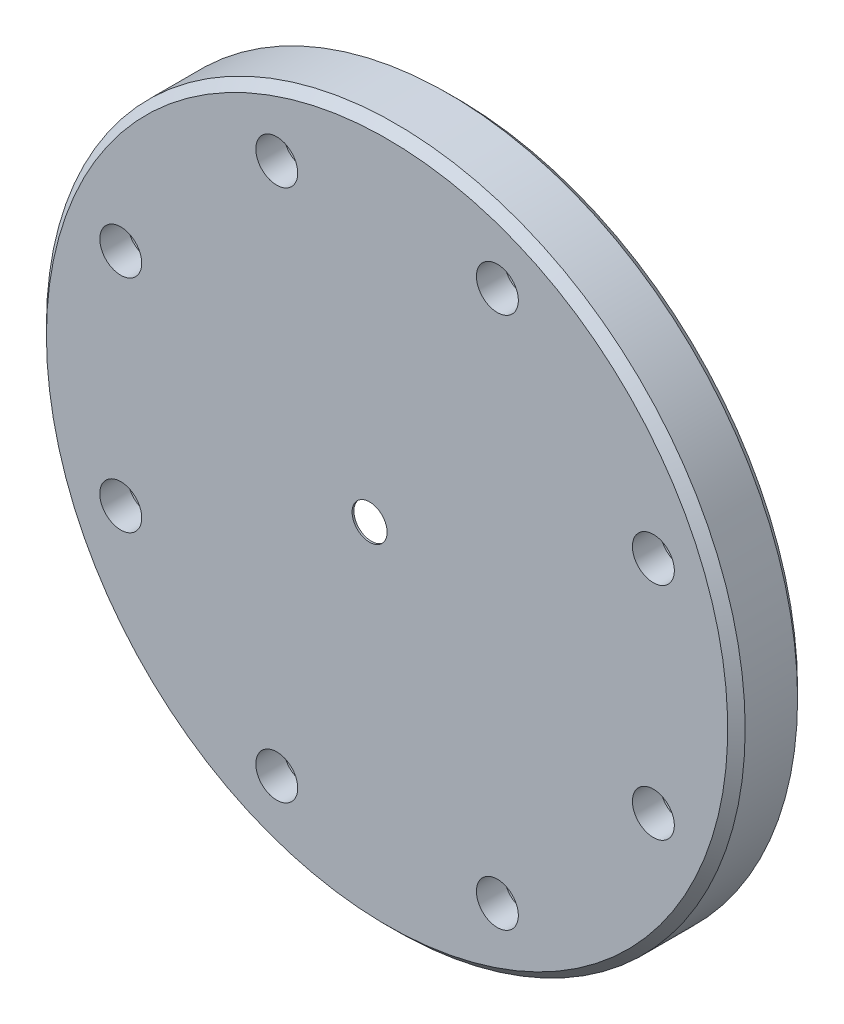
ISO-10303-21;
HEADER;
FILE_DESCRIPTION(('STEP AP214'),'2;1');
FILE_NAME('part.step','',(''),(''),'','','');
FILE_SCHEMA(('AUTOMOTIVE_DESIGN { 1 0 10303 214 1 1 1 1 }'));
ENDSEC;
DATA;
#1=APPLICATION_CONTEXT('core data for automotive mechanical design processes');
#2=APPLICATION_PROTOCOL_DEFINITION('international standard','automotive_design',2000,#1);
#3=PRODUCT_CONTEXT('',#1,'mechanical');
#4=PRODUCT('Part','Part','',(#3));
#5=PRODUCT_RELATED_PRODUCT_CATEGORY('part','',(#4));
#6=PRODUCT_DEFINITION_FORMATION('','',#4);
#7=PRODUCT_DEFINITION_CONTEXT('part definition',#1,'design');
#8=PRODUCT_DEFINITION('design','',#6,#7);
#9=PRODUCT_DEFINITION_SHAPE('','',#8);
#10=(LENGTH_UNIT() NAMED_UNIT(*) SI_UNIT(.MILLI.,.METRE.));
#11=(NAMED_UNIT(*) PLANE_ANGLE_UNIT() SI_UNIT($,.RADIAN.));
#12=(NAMED_UNIT(*) SI_UNIT($,.STERADIAN.) SOLID_ANGLE_UNIT());
#13=UNCERTAINTY_MEASURE_WITH_UNIT(LENGTH_MEASURE(1.E-05),#10,'distance_accuracy_value','');
#14=(GEOMETRIC_REPRESENTATION_CONTEXT(3) GLOBAL_UNCERTAINTY_ASSIGNED_CONTEXT((#13)) GLOBAL_UNIT_ASSIGNED_CONTEXT((#10,
#11,#12)) REPRESENTATION_CONTEXT('',''));
#15=CARTESIAN_POINT('',(0.,0.,0.));
#16=DIRECTION('',(0.,0.,1.));
#17=DIRECTION('',(1.,0.,0.));
#18=AXIS2_PLACEMENT_3D('',#15,#16,#17);
#19=CARTESIAN_POINT('',(0.,0.,-4.));
#20=DIRECTION('',(0.,0.,1.));
#21=DIRECTION('',(1.,0.,0.));
#22=AXIS2_PLACEMENT_3D('',#19,#20,#21);
#23=PLANE('',#22);
#24=CARTESIAN_POINT('',(0.,0.,-4.));
#25=DIRECTION('',(0.,0.,1.));
#26=DIRECTION('',(1.,0.,0.));
#27=AXIS2_PLACEMENT_3D('',#24,#25,#26);
#28=CIRCLE('',#27,19.5);
#29=CARTESIAN_POINT('',(19.5,0.,-4.));
#30=VERTEX_POINT('',#29);
#31=EDGE_CURVE('E42',#30,#30,#28,.F.);
#32=ORIENTED_EDGE('',*,*,#31,.T.);
#33=EDGE_LOOP('',(#32));
#34=FACE_BOUND('',#33,.T.);
#35=CARTESIAN_POINT('',(6.31427663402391,15.2440122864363,-4.));
#36=DIRECTION('',(0.,0.,-1.));
#37=DIRECTION('',(-1.,0.,0.));
#38=AXIS2_PLACEMENT_3D('',#35,#36,#37);
#39=CIRCLE('',#38,2.19999999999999);
#40=CARTESIAN_POINT('',(4.19245168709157,14.6627559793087,-4.));
#41=VERTEX_POINT('',#40);
#42=CARTESIAN_POINT('',(7.18854939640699,13.2251890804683,-4.));
#43=VERTEX_POINT('',#42);
#44=EDGE_CURVE('E48',#41,#43,#39,.T.);
#45=ORIENTED_EDGE('',*,*,#44,.F.);
#46=CARTESIAN_POINT('',(-1.,0.,-4.));
#47=DIRECTION('',(0.,0.,-1.));
#48=DIRECTION('',(-1.,0.,0.));
#49=AXIS2_PLACEMENT_3D('',#46,#47,#48);
#50=CIRCLE('',#49,15.5549981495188);
#51=CARTESIAN_POINT('',(-4.11428019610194,15.2400533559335,-4.));
#52=VERTEX_POINT('',#51);
#53=EDGE_CURVE('E108',#52,#41,#50,.T.);
#54=ORIENTED_EDGE('',*,*,#53,.F.);
#55=CARTESIAN_POINT('',(-6.31427663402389,15.2440122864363,-4.));
#56=DIRECTION('',(0.,0.,-1.));
#57=DIRECTION('',(-1.,0.,0.));
#58=AXIS2_PLACEMENT_3D('',#55,#56,#57);
#59=CIRCLE('',#58,2.19999999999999);
#60=CARTESIAN_POINT('',(-8.03501861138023,13.8732289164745,-4.));
#61=VERTEX_POINT('',#60);
#62=EDGE_CURVE('E116',#61,#52,#59,.T.);
#63=ORIENTED_EDGE('',*,*,#62,.F.);
#64=CARTESIAN_POINT('',(-14.1898872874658,8.24529203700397,-4.));
#65=VERTEX_POINT('',#64);
#66=EDGE_CURVE('E118',#65,#61,#50,.T.);
#67=ORIENTED_EDGE('',*,*,#66,.F.);
#68=CARTESIAN_POINT('',(-15.2440122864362,6.31427663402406,-4.));
#69=DIRECTION('',(0.,0.,-1.));
#70=DIRECTION('',(-1.,0.,0.));
#71=AXIS2_PLACEMENT_3D('',#68,#69,#70);
#72=CIRCLE('',#71,2.19999999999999);
#73=CARTESIAN_POINT('',(-15.9669762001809,4.23645970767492,-4.));
#74=VERTEX_POINT('',#73);
#75=EDGE_CURVE('E144',#74,#65,#72,.T.);
#76=ORIENTED_EDGE('',*,*,#75,.F.);
#77=CARTESIAN_POINT('',(-15.9669762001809,-4.23645970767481,-4.));
#78=VERTEX_POINT('',#77);
#79=EDGE_CURVE('E123',#78,#74,#50,.T.);
#80=ORIENTED_EDGE('',*,*,#79,.F.);
#81=CARTESIAN_POINT('',(-15.2440122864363,-6.31427663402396,-4.));
#82=DIRECTION('',(0.,0.,-1.));
#83=DIRECTION('',(-1.,0.,0.));
#84=AXIS2_PLACEMENT_3D('',#81,#82,#83);
#85=CIRCLE('',#84,2.19999999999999);
#86=CARTESIAN_POINT('',(-14.1898872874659,-8.24529203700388,-4.));
#87=VERTEX_POINT('',#86);
#88=EDGE_CURVE('E155',#87,#78,#85,.T.);
#89=ORIENTED_EDGE('',*,*,#88,.F.);
#90=CARTESIAN_POINT('',(-8.03501861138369,-13.8732289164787,-4.));
#91=VERTEX_POINT('',#90);
#92=EDGE_CURVE('E127',#91,#87,#50,.T.);
#93=ORIENTED_EDGE('',*,*,#92,.F.);
#94=CARTESIAN_POINT('',(-6.31427663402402,-15.2440122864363,-4.));
#95=DIRECTION('',(0.,0.,-1.));
#96=DIRECTION('',(-1.,0.,0.));
#97=AXIS2_PLACEMENT_3D('',#94,#95,#96);
#98=CIRCLE('',#97,2.19999999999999);
#99=CARTESIAN_POINT('',(-4.11428019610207,-15.2400533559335,-4.));
#100=VERTEX_POINT('',#99);
#101=EDGE_CURVE('E166',#100,#91,#98,.T.);
#102=ORIENTED_EDGE('',*,*,#101,.F.);
#103=CARTESIAN_POINT('',(4.19245168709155,-14.6627559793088,-4.));
#104=VERTEX_POINT('',#103);
#105=EDGE_CURVE('E567',#104,#100,#50,.T.);
#106=ORIENTED_EDGE('',*,*,#105,.F.);
#107=CARTESIAN_POINT('',(6.31427663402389,-15.2440122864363,-4.));
#108=DIRECTION('',(0.,0.,-1.));
#109=DIRECTION('',(-1.,0.,0.));
#110=AXIS2_PLACEMENT_3D('',#107,#108,#109);
#111=CIRCLE('',#110,2.19999999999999);
#112=CARTESIAN_POINT('',(7.18854939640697,-13.2251890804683,-4.));
#113=VERTEX_POINT('',#112);
#114=EDGE_CURVE('E177',#113,#104,#111,.T.);
#115=ORIENTED_EDGE('',*,*,#114,.F.);
#116=CARTESIAN_POINT('',(13.0678530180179,-6.63727947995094,-4.));
#117=VERTEX_POINT('',#116);
#118=EDGE_CURVE('E569',#117,#113,#50,.T.);
#119=ORIENTED_EDGE('',*,*,#118,.F.);
#120=CARTESIAN_POINT('',(15.2440122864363,-6.31427663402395,-4.));
#121=DIRECTION('',(0.,0.,-1.));
#122=DIRECTION('',(-1.,0.,0.));
#123=AXIS2_PLACEMENT_3D('',#120,#121,#122);
#124=CIRCLE('',#123,2.19999999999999);
#125=CARTESIAN_POINT('',(13.8573083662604,-4.60633862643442,-4.));
#126=VERTEX_POINT('',#125);
#127=EDGE_CURVE('E188',#126,#117,#124,.T.);
#128=ORIENTED_EDGE('',*,*,#127,.F.);
#129=CARTESIAN_POINT('',(13.8573083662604,4.60633862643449,-4.));
#130=VERTEX_POINT('',#129);
#131=EDGE_CURVE('E121',#130,#126,#50,.T.);
#132=ORIENTED_EDGE('',*,*,#131,.F.);
#133=CARTESIAN_POINT('',(15.2440122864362,6.31427663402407,-4.));
#134=DIRECTION('',(0.,0.,-1.));
#135=DIRECTION('',(-1.,0.,0.));
#136=AXIS2_PLACEMENT_3D('',#133,#134,#135);
#137=CIRCLE('',#136,2.19999999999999);
#138=CARTESIAN_POINT('',(13.0678530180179,6.63727947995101,-4.));
#139=VERTEX_POINT('',#138);
#140=EDGE_CURVE('E55',#139,#130,#137,.T.);
#141=ORIENTED_EDGE('',*,*,#140,.F.);
#142=EDGE_CURVE('E110',#43,#139,#50,.T.);
#143=ORIENTED_EDGE('',*,*,#142,.F.);
#144=EDGE_LOOP('',(#45,#54,#63,#67,#76,#80,#89,#93,#102,#106,#115,#119,#128,#132,#141,#143));
#145=FACE_BOUND('',#144,.T.);
#146=ADVANCED_FACE('F34',(#34,#145),#23,.F.);
#147=CARTESIAN_POINT('',(0.,0.,8.20296037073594));
#148=DIRECTION('',(0.,0.,1.));
#149=DIRECTION('',(1.,0.,0.));
#150=AXIS2_PLACEMENT_3D('',#147,#148,#149);
#151=CYLINDRICAL_SURFACE('',#150,20.);
#152=CARTESIAN_POINT('',(0.,0.,-3.5));
#153=DIRECTION('',(0.,0.,1.));
#154=DIRECTION('',(1.,0.,0.));
#155=AXIS2_PLACEMENT_3D('',#152,#153,#154);
#156=CIRCLE('',#155,20.);
#157=CARTESIAN_POINT('',(20.,0.,-3.5));
#158=VERTEX_POINT('',#157);
#159=EDGE_CURVE('E256',#158,#158,#156,.T.);
#160=ORIENTED_EDGE('',*,*,#159,.T.);
#161=EDGE_LOOP('',(#160));
#162=FACE_BOUND('',#161,.T.);
#163=CARTESIAN_POINT('',(0.,0.,-0.50000000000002));
#164=DIRECTION('',(0.,0.,-1.));
#165=DIRECTION('',(-1.,0.,0.));
#166=AXIS2_PLACEMENT_3D('',#163,#164,#165);
#167=CIRCLE('',#166,20.);
#168=CARTESIAN_POINT('',(-20.,0.,-0.50000000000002));
#169=VERTEX_POINT('',#168);
#170=EDGE_CURVE('E102',#169,#169,#167,.T.);
#171=ORIENTED_EDGE('',*,*,#170,.T.);
#172=EDGE_LOOP('',(#171));
#173=FACE_BOUND('',#172,.T.);
#174=ADVANCED_FACE('F227',(#162,#173),#151,.T.);
#175=CARTESIAN_POINT('',(0.,20.,0.));
#176=DIRECTION('',(0.,0.,-1.));
#177=DIRECTION('',(-1.,0.,0.));
#178=AXIS2_PLACEMENT_3D('',#175,#176,#177);
#179=PLANE('',#178);
#180=CARTESIAN_POINT('',(0.,0.,0.));
#181=DIRECTION('',(0.,0.,-1.));
#182=DIRECTION('',(-1.,0.,0.));
#183=AXIS2_PLACEMENT_3D('',#180,#181,#182);
#184=CIRCLE('',#183,19.5);
#185=CARTESIAN_POINT('',(-19.5,0.,0.));
#186=VERTEX_POINT('',#185);
#187=EDGE_CURVE('E11',#186,#186,#184,.F.);
#188=ORIENTED_EDGE('',*,*,#187,.T.);
#189=EDGE_LOOP('',(#188));
#190=FACE_BOUND('',#189,.T.);
#191=CARTESIAN_POINT('',(6.31427663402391,15.2440122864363,0.));
#192=DIRECTION('',(0.,0.,-1.));
#193=DIRECTION('',(-1.,0.,0.));
#194=AXIS2_PLACEMENT_3D('',#191,#192,#193);
#195=CIRCLE('',#194,1.2);
#196=CARTESIAN_POINT('',(5.11427663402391,15.2440122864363,0.));
#197=VERTEX_POINT('',#196);
#198=EDGE_CURVE('E200',#197,#197,#195,.T.);
#199=ORIENTED_EDGE('',*,*,#198,.T.);
#200=EDGE_LOOP('',(#199));
#201=FACE_BOUND('',#200,.T.);
#202=CARTESIAN_POINT('',(15.2440122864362,6.31427663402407,0.));
#203=DIRECTION('',(0.,0.,-1.));
#204=DIRECTION('',(-1.,0.,0.));
#205=AXIS2_PLACEMENT_3D('',#202,#203,#204);
#206=CIRCLE('',#205,1.2);
#207=CARTESIAN_POINT('',(14.0440122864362,6.31427663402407,0.));
#208=VERTEX_POINT('',#207);
#209=EDGE_CURVE('E190',#208,#208,#206,.T.);
#210=ORIENTED_EDGE('',*,*,#209,.T.);
#211=EDGE_LOOP('',(#210));
#212=FACE_BOUND('',#211,.T.);
#213=CARTESIAN_POINT('',(15.2440122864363,-6.31427663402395,0.));
#214=DIRECTION('',(0.,0.,-1.));
#215=DIRECTION('',(-1.,0.,0.));
#216=AXIS2_PLACEMENT_3D('',#213,#214,#215);
#217=CIRCLE('',#216,1.2);
#218=CARTESIAN_POINT('',(14.0440122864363,-6.31427663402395,0.));
#219=VERTEX_POINT('',#218);
#220=EDGE_CURVE('E179',#219,#219,#217,.T.);
#221=ORIENTED_EDGE('',*,*,#220,.T.);
#222=EDGE_LOOP('',(#221));
#223=FACE_BOUND('',#222,.T.);
#224=CARTESIAN_POINT('',(6.31427663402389,-15.2440122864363,0.));
#225=DIRECTION('',(0.,0.,-1.));
#226=DIRECTION('',(-1.,0.,0.));
#227=AXIS2_PLACEMENT_3D('',#224,#225,#226);
#228=CIRCLE('',#227,1.2);
#229=CARTESIAN_POINT('',(5.11427663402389,-15.2440122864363,0.));
#230=VERTEX_POINT('',#229);
#231=EDGE_CURVE('E168',#230,#230,#228,.T.);
#232=ORIENTED_EDGE('',*,*,#231,.T.);
#233=EDGE_LOOP('',(#232));
#234=FACE_BOUND('',#233,.T.);
#235=CARTESIAN_POINT('',(-6.31427663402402,-15.2440122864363,0.));
#236=DIRECTION('',(0.,0.,-1.));
#237=DIRECTION('',(-1.,0.,0.));
#238=AXIS2_PLACEMENT_3D('',#235,#236,#237);
#239=CIRCLE('',#238,1.2);
#240=CARTESIAN_POINT('',(-7.51427663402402,-15.2440122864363,0.));
#241=VERTEX_POINT('',#240);
#242=EDGE_CURVE('E157',#241,#241,#239,.T.);
#243=ORIENTED_EDGE('',*,*,#242,.T.);
#244=EDGE_LOOP('',(#243));
#245=FACE_BOUND('',#244,.T.);
#246=CARTESIAN_POINT('',(-15.2440122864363,-6.31427663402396,0.));
#247=DIRECTION('',(0.,0.,-1.));
#248=DIRECTION('',(-1.,0.,0.));
#249=AXIS2_PLACEMENT_3D('',#246,#247,#248);
#250=CIRCLE('',#249,1.2);
#251=CARTESIAN_POINT('',(-16.4440122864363,-6.31427663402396,0.));
#252=VERTEX_POINT('',#251);
#253=EDGE_CURVE('E146',#252,#252,#250,.T.);
#254=ORIENTED_EDGE('',*,*,#253,.T.);
#255=EDGE_LOOP('',(#254));
#256=FACE_BOUND('',#255,.T.);
#257=CARTESIAN_POINT('',(-15.2440122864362,6.31427663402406,0.));
#258=DIRECTION('',(0.,0.,-1.));
#259=DIRECTION('',(-1.,0.,0.));
#260=AXIS2_PLACEMENT_3D('',#257,#258,#259);
#261=CIRCLE('',#260,1.2);
#262=CARTESIAN_POINT('',(-16.4440122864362,6.31427663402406,0.));
#263=VERTEX_POINT('',#262);
#264=EDGE_CURVE('E133',#263,#263,#261,.T.);
#265=ORIENTED_EDGE('',*,*,#264,.T.);
#266=EDGE_LOOP('',(#265));
#267=FACE_BOUND('',#266,.T.);
#268=CARTESIAN_POINT('',(-1.,0.,0.));
#269=DIRECTION('',(0.,0.,-1.));
#270=DIRECTION('',(-1.,0.,0.));
#271=AXIS2_PLACEMENT_3D('',#268,#269,#270);
#272=CIRCLE('',#271,1.);
#273=CARTESIAN_POINT('',(-2.,0.,0.));
#274=VERTEX_POINT('',#273);
#275=EDGE_CURVE('E129',#274,#274,#272,.T.);
#276=ORIENTED_EDGE('',*,*,#275,.T.);
#277=EDGE_LOOP('',(#276));
#278=FACE_BOUND('',#277,.T.);
#279=CARTESIAN_POINT('',(-6.31427663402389,15.2440122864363,0.));
#280=DIRECTION('',(0.,0.,-1.));
#281=DIRECTION('',(-1.,0.,0.));
#282=AXIS2_PLACEMENT_3D('',#279,#280,#281);
#283=CIRCLE('',#282,1.2);
#284=CARTESIAN_POINT('',(-7.51427663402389,15.2440122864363,0.));
#285=VERTEX_POINT('',#284);
#286=EDGE_CURVE('E395',#285,#285,#283,.T.);
#287=ORIENTED_EDGE('',*,*,#286,.T.);
#288=EDGE_LOOP('',(#287));
#289=FACE_BOUND('',#288,.T.);
#290=ADVANCED_FACE('F233',(#190,#201,#212,#223,#234,#245,#256,#267,#278,#289),#179,.F.);
#291=CARTESIAN_POINT('',(-6.31427663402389,15.2440122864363,-4.));
#292=DIRECTION('',(0.,0.,-1.));
#293=DIRECTION('',(-1.,0.,0.));
#294=AXIS2_PLACEMENT_3D('',#291,#292,#293);
#295=CYLINDRICAL_SURFACE('',#294,1.2);
#296=ORIENTED_EDGE('',*,*,#286,.F.);
#297=EDGE_LOOP('',(#296));
#298=FACE_BOUND('',#297,.T.);
#299=CARTESIAN_POINT('',(-6.31427663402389,15.2440122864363,-1.6));
#300=DIRECTION('',(0.,0.,-1.));
#301=DIRECTION('',(-1.,0.,0.));
#302=AXIS2_PLACEMENT_3D('',#299,#300,#301);
#303=CIRCLE('',#302,1.2);
#304=CARTESIAN_POINT('',(-7.51427663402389,15.2440122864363,-1.6));
#305=VERTEX_POINT('',#304);
#306=EDGE_CURVE('E397',#305,#305,#303,.T.);
#307=ORIENTED_EDGE('',*,*,#306,.T.);
#308=EDGE_LOOP('',(#307));
#309=FACE_BOUND('',#308,.T.);
#310=ADVANCED_FACE('F239',(#298,#309),#295,.F.);
#311=CARTESIAN_POINT('',(-5.11427663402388,15.2440122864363,-1.6));
#312=DIRECTION('',(0.,0.,1.));
#313=DIRECTION('',(1.,0.,0.));
#314=AXIS2_PLACEMENT_3D('',#311,#312,#313);
#315=PLANE('',#314);
#316=ORIENTED_EDGE('',*,*,#306,.F.);
#317=EDGE_LOOP('',(#316));
#318=FACE_BOUND('',#317,.T.);
#319=CARTESIAN_POINT('',(-6.31427663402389,15.2440122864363,-1.6));
#320=DIRECTION('',(0.,0.,-1.));
#321=DIRECTION('',(-1.,0.,0.));
#322=AXIS2_PLACEMENT_3D('',#319,#320,#321);
#323=CIRCLE('',#322,2.2);
#324=CARTESIAN_POINT('',(-8.51427663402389,15.2440122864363,-1.6));
#325=VERTEX_POINT('',#324);
#326=EDGE_CURVE('E119',#325,#325,#323,.T.);
#327=ORIENTED_EDGE('',*,*,#326,.T.);
#328=EDGE_LOOP('',(#327));
#329=FACE_BOUND('',#328,.T.);
#330=ADVANCED_FACE('F406',(#318,#329),#315,.F.);
#331=CARTESIAN_POINT('',(-6.31427663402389,15.2440122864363,-4.));
#332=DIRECTION('',(0.,0.,-1.));
#333=DIRECTION('',(-1.,0.,0.));
#334=AXIS2_PLACEMENT_3D('',#331,#332,#333);
#335=CYLINDRICAL_SURFACE('',#334,2.19999999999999);
#336=ORIENTED_EDGE('',*,*,#326,.F.);
#337=EDGE_LOOP('',(#336));
#338=FACE_BOUND('',#337,.T.);
#339=ORIENTED_EDGE('',*,*,#62,.T.);
#340=CARTESIAN_POINT('',(-4.11427895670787,15.2408154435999,-4.00020000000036));
#341=CARTESIAN_POINT('',(-4.1143716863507,15.1781912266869,-3.9837652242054));
#342=CARTESIAN_POINT('',(-4.1171365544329,15.1155628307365,-3.96747547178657));
#343=CARTESIAN_POINT('',(-4.12801288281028,14.9906622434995,-3.93529774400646));
#344=CARTESIAN_POINT('',(-4.13612485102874,14.928390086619,-3.9194098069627));
#345=CARTESIAN_POINT('',(-4.16848479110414,14.7426688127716,-3.87251999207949));
#346=CARTESIAN_POINT('',(-4.20075679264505,14.6203190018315,-3.84229319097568));
#347=CARTESIAN_POINT('',(-4.2861427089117,14.3822076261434,-3.78502408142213));
#348=CARTESIAN_POINT('',(-4.33928090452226,14.2664539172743,-3.75798553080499));
#349=CARTESIAN_POINT('',(-4.46520947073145,14.0452106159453,-3.70823082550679));
#350=CARTESIAN_POINT('',(-4.5379857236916,13.9397137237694,-3.68551158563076));
#351=CARTESIAN_POINT('',(-4.69915041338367,13.7450446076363,-3.64597372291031));
#352=CARTESIAN_POINT('',(-4.78706321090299,13.6555079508,-3.62901209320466));
#353=CARTESIAN_POINT('',(-4.97740499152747,13.4923045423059,-3.60099304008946));
#354=CARTESIAN_POINT('',(-5.07983337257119,13.4186371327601,-3.58993537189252));
#355=CARTESIAN_POINT('',(-5.29169136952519,13.2923716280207,-3.5746398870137));
#356=CARTESIAN_POINT('',(-5.40066139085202,13.2390331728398,-3.57014090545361));
#357=CARTESIAN_POINT('',(-5.62593785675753,13.1509744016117,-3.56735139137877));
#358=CARTESIAN_POINT('',(-5.74224261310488,13.1162498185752,-3.56905943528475));
#359=CARTESIAN_POINT('',(-5.97616139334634,13.0669362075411,-3.57848753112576));
#360=CARTESIAN_POINT('',(-6.09369283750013,13.0519283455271,-3.58607689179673));
#361=CARTESIAN_POINT('',(-6.32915173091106,13.0409075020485,-3.6067379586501));
#362=CARTESIAN_POINT('',(-6.44707918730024,13.0448948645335,-3.61980976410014));
#363=CARTESIAN_POINT('',(-6.68148915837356,13.0716326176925,-3.65101991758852));
#364=CARTESIAN_POINT('',(-6.79793928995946,13.0945990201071,-3.66921499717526));
#365=CARTESIAN_POINT('',(-7.02499843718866,13.1586356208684,-3.70984226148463));
#366=CARTESIAN_POINT('',(-7.13560523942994,13.1997126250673,-3.73227603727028));
#367=CARTESIAN_POINT('',(-7.3521472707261,13.3004055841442,-3.78141177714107));
#368=CARTESIAN_POINT('',(-7.45776261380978,13.3606459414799,-3.80824005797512));
#369=CARTESIAN_POINT('',(-7.65713477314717,13.4972143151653,-3.86456301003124));
#370=CARTESIAN_POINT('',(-7.75090224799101,13.5735277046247,-3.89405524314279));
#371=CARTESIAN_POINT('',(-7.87303544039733,13.6907275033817,-3.93678736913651));
#372=CARTESIAN_POINT('',(-7.9072968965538,13.7258898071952,-3.94932906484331));
#373=CARTESIAN_POINT('',(-7.97329177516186,13.7983085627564,-3.97461765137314));
#374=CARTESIAN_POINT('',(-8.00503000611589,13.8355607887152,-3.98736409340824));
#375=CARTESIAN_POINT('',(-8.03549335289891,13.8738250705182,-4.00019999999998));
#376=B_SPLINE_CURVE_WITH_KNOTS('',3,(#340,#341,#342,#343,#344,#345,#346,#347,#348,#349,#350,
#351,#352,#353,#354,#355,#356,#357,#358,#359,#360,#361,#362,#363,#364,#365,#366,#367,#368,#369,
#370,#371,#372,#373,#374,#375),.UNSPECIFIED.,.F.,.F.,(4,2,2,2,2,2,2,2,2,2,2,2,2,2,2,2,2,4),(0.,
0.194120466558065,0.388259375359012,0.776549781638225,1.16529336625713,1.55375822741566,
1.93171354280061,2.30965318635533,2.6720884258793,3.03444054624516,3.3889637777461,
3.74349342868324,4.10211468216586,4.4608708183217,4.83277826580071,5.204348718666,
5.35627604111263,5.50790652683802),.UNSPECIFIED.);
#377=EDGE_CURVE('E115',#52,#61,#376,.T.);
#378=ORIENTED_EDGE('',*,*,#377,.T.);
#379=EDGE_LOOP('',(#339,#378));
#380=FACE_BOUND('',#379,.T.);
#381=ADVANCED_FACE('F275',(#338,#380),#335,.F.);
#382=CARTESIAN_POINT('',(-1.,0.,-4.));
#383=DIRECTION('',(0.,0.,-1.));
#384=DIRECTION('',(-1.,0.,0.));
#385=AXIS2_PLACEMENT_3D('',#382,#383,#384);
#386=CONICAL_SURFACE('',#385,15.5549981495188,1.30899693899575);
#387=CARTESIAN_POINT('',(-1.,0.,-0.1));
#388=DIRECTION('',(0.,0.,-1.));
#389=DIRECTION('',(-1.,0.,0.));
#390=AXIS2_PLACEMENT_3D('',#387,#388,#389);
#391=CIRCLE('',#390,1.);
#392=CARTESIAN_POINT('',(-2.,0.,-0.1));
#393=VERTEX_POINT('',#392);
#394=EDGE_CURVE('E124',#393,#393,#391,.T.);
#395=ORIENTED_EDGE('',*,*,#394,.F.);
#396=EDGE_LOOP('',(#395));
#397=FACE_BOUND('',#396,.T.);
#398=ORIENTED_EDGE('',*,*,#53,.T.);
#399=CARTESIAN_POINT('',(4.11621604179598,15.3363682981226,-4.16405144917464));
#400=CARTESIAN_POINT('',(4.11384887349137,15.2800118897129,-4.14952652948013));
#401=CARTESIAN_POINT('',(4.11364768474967,15.2235439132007,-4.13516213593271));
#402=CARTESIAN_POINT('',(4.11759524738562,15.1106567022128,-4.1068383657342));
#403=CARTESIAN_POINT('',(4.12174415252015,15.0542374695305,-4.09287900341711));
#404=CARTESIAN_POINT('',(4.14074862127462,14.8854168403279,-4.05172378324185));
#405=CARTESIAN_POINT('',(4.16216407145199,14.7735029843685,-4.02526382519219));
#406=CARTESIAN_POINT('',(4.22418214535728,14.5467316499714,-3.97353226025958));
#407=CARTESIAN_POINT('',(4.26592491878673,14.4321441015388,-3.9484450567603));
#408=CARTESIAN_POINT('',(4.36817036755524,14.2108044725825,-3.90238136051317));
#409=CARTESIAN_POINT('',(4.42866502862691,14.10404906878,-3.88140311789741));
#410=CARTESIAN_POINT('',(4.56719448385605,13.901328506,-3.84440805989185));
#411=CARTESIAN_POINT('',(4.64525924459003,13.8053822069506,-3.82839983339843));
#412=CARTESIAN_POINT('',(4.81686498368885,13.6275274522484,-3.80215538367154));
#413=CARTESIAN_POINT('',(4.91040651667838,13.5456194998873,-3.79191936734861));
#414=CARTESIAN_POINT('',(5.10743944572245,13.4006231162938,-3.77794859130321));
#415=CARTESIAN_POINT('',(5.21057606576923,13.3370692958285,-3.77403871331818));
#416=CARTESIAN_POINT('',(5.425895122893,13.2277411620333,-3.77236833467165));
#417=CARTESIAN_POINT('',(5.53807499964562,13.1819618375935,-3.77460609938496));
#418=CARTESIAN_POINT('',(5.76586297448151,13.1101838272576,-3.78500703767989));
#419=CARTESIAN_POINT('',(5.88135899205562,13.0838109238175,-3.79305184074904));
#420=CARTESIAN_POINT('',(6.11464643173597,13.0499188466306,-3.81455712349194));
#421=CARTESIAN_POINT('',(6.23243906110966,13.0424098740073,-3.82802052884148));
#422=CARTESIAN_POINT('',(6.4686344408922,13.0462120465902,-3.85997502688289));
#423=CARTESIAN_POINT('',(6.5870235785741,13.0577814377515,-3.87853222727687));
#424=CARTESIAN_POINT('',(6.81953093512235,13.0995718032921,-3.91979835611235));
#425=CARTESIAN_POINT('',(6.93365716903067,13.1297556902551,-3.94249896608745));
#426=CARTESIAN_POINT('',(7.06874928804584,13.1772631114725,-3.9722318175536));
#427=CARTESIAN_POINT('',(7.09313653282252,13.1863308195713,-3.97771871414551));
#428=CARTESIAN_POINT('',(7.14154049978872,13.205309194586,-3.98884559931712));
#429=CARTESIAN_POINT('',(7.16555728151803,13.2152197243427,-3.99448556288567));
#430=CARTESIAN_POINT('',(7.30627713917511,13.2762342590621,-4.02823552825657));
#431=CARTESIAN_POINT('',(7.41858447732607,13.3370334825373,-4.05806361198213));
#432=CARTESIAN_POINT('',(7.6308397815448,13.4768402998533,-4.12019134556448));
#433=CARTESIAN_POINT('',(7.7307465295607,13.5559062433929,-4.15249868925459));
#434=CARTESIAN_POINT('',(7.9058412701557,13.7209036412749,-4.21510075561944));
#435=CARTESIAN_POINT('',(7.982511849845,13.8053084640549,-4.24526389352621));
#436=CARTESIAN_POINT('',(8.08686743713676,13.9397359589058,-4.2907075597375));
#437=CARTESIAN_POINT('',(8.11984018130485,13.9857810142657,-4.30586798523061));
#438=CARTESIAN_POINT('',(8.18214049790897,14.0802751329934,-4.33619512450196));
#439=CARTESIAN_POINT('',(8.21146793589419,14.1287242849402,-4.35136183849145));
#440=CARTESIAN_POINT('',(8.23889887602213,14.1782593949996,-4.36649453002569));
#441=B_SPLINE_CURVE_WITH_KNOTS('',3,(#399,#400,#401,#402,#403,#404,#405,#406,#407,#408,#409,
#410,#411,#412,#413,#414,#415,#416,#417,#418,#419,#420,#421,#422,#423,#424,#425,#426,#427,#428,
#429,#430,#431,#432,#433,#434,#435,#436,#437,#438,#439,#440),.UNSPECIFIED.,.F.,.F.,(4,2,2,2,2,2,
2,2,2,2,2,2,2,2,2,2,2,2,2,2,4),(0.,0.174656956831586,0.349320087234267,0.698801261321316,
1.07064685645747,1.44233374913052,1.81465943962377,2.1869984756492,2.54884239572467,
2.91058422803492,3.26515333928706,3.61991415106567,3.97951655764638,4.33840479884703,
4.41816896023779,4.49792016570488,4.88918655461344,5.28172048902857,5.63415202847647,
5.80989340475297,5.98564126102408),.UNSPECIFIED.);
#442=EDGE_CURVE('E97',#41,#43,#441,.T.);
#443=ORIENTED_EDGE('',*,*,#442,.T.);
#444=ORIENTED_EDGE('',*,*,#142,.T.);
#445=CARTESIAN_POINT('',(13.0680508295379,6.63860939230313,-4.00020000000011));
#446=CARTESIAN_POINT('',(13.059309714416,6.57996317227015,-3.99137544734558));
#447=CARTESIAN_POINT('',(13.0529316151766,6.5209018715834,-3.98313924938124));
#448=CARTESIAN_POINT('',(13.0449691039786,6.40229109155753,-3.96792066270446));
#449=CARTESIAN_POINT('',(13.0433851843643,6.34274156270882,-3.96093840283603));
#450=CARTESIAN_POINT('',(13.0459257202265,6.16406458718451,-3.94200904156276));
#451=CARTESIAN_POINT('',(13.0573167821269,6.04473690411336,-3.93205335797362));
#452=CARTESIAN_POINT('',(13.0994461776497,5.8091080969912,-3.91795941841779));
#453=CARTESIAN_POINT('',(13.1302058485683,5.69281045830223,-3.91382759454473));
#454=CARTESIAN_POINT('',(13.210296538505,5.46670920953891,-3.91159892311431));
#455=CARTESIAN_POINT('',(13.2596274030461,5.35690554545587,-3.91350202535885));
#456=CARTESIAN_POINT('',(13.3746574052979,5.14827977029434,-3.92318693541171));
#457=CARTESIAN_POINT('',(13.4401542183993,5.0493422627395,-3.93089832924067));
#458=CARTESIAN_POINT('',(13.5857911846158,4.86369854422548,-3.95175096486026));
#459=CARTESIAN_POINT('',(13.6659084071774,4.77697355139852,-3.96488374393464));
#460=CARTESIAN_POINT('',(13.769286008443,4.68156781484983,-3.98352093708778));
#461=CARTESIAN_POINT('',(13.786786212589,4.66593066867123,-3.98672857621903));
#462=CARTESIAN_POINT('',(13.8222324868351,4.63526250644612,-3.99332713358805));
#463=CARTESIAN_POINT('',(13.8401778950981,4.62023066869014,-3.99671778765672));
#464=CARTESIAN_POINT('',(13.8583524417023,4.60549145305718,-4.0002));
#465=B_SPLINE_CURVE_WITH_KNOTS('',3,(#445,#446,#447,#448,#449,#450,#451,#452,#453,#454,#455,
#456,#457,#458,#459,#460,#461,#462,#463,#464),.UNSPECIFIED.,.F.,.F.,(4,2,2,2,2,2,2,2,2,4),(0.,
0.179738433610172,0.359495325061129,0.718488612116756,1.07787807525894,1.43726454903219,
1.79236292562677,2.1469090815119,2.21796437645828,2.28891971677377),.UNSPECIFIED.);
#466=EDGE_CURVE('E103',#139,#130,#465,.T.);
#467=ORIENTED_EDGE('',*,*,#466,.T.);
#468=ORIENTED_EDGE('',*,*,#131,.T.);
#469=CARTESIAN_POINT('',(13.8583524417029,-4.6054914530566,-4.00020000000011));
#470=CARTESIAN_POINT('',(13.8122976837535,-4.64283774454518,-3.99137544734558));
#471=CARTESIAN_POINT('',(13.7677052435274,-4.68208607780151,-3.98313924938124));
#472=CARTESIAN_POINT('',(13.681725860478,-4.76418031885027,-3.96792066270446));
#473=CARTESIAN_POINT('',(13.6403392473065,-4.80702659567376,-3.96093840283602));
#474=CARTESIAN_POINT('',(13.5215380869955,-4.94051142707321,-3.94200904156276));
#475=CARTESIAN_POINT('',(13.4493472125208,-5.03620536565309,-3.93205335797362));
#476=CARTESIAN_POINT('',(13.3212775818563,-5.23842799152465,-3.91795941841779));
#477=CARTESIAN_POINT('',(13.2654169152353,-5.34496851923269,-3.91382759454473));
#478=CARTESIAN_POINT('',(13.171777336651,-5.56580312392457,-3.9115989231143));
#479=CARTESIAN_POINT('',(13.1339982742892,-5.68009713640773,-3.91350202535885));
#480=CARTESIAN_POINT('',(13.0779279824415,-5.91164138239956,-3.9231869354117));
#481=CARTESIAN_POINT('',(13.0594096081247,-6.02884007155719,-3.93089832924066));
#482=CARTESIAN_POINT('',(13.0414326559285,-6.26410703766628,-3.95175096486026));
#483=CARTESIAN_POINT('',(13.0419444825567,-6.38217367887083,-3.96488374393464));
#484=CARTESIAN_POINT('',(13.0537473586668,-6.52235169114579,-3.98352093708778));
#485=CARTESIAN_POINT('',(13.0560922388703,-6.54570290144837,-3.98672857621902));
#486=CARTESIAN_POINT('',(13.0615201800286,-6.59225944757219,-3.99332713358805));
#487=CARTESIAN_POINT('',(13.0646021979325,-6.61546494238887,-3.99671778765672));
#488=CARTESIAN_POINT('',(13.0680508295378,-6.63860939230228,-4.0002));
#489=B_SPLINE_CURVE_WITH_KNOTS('',3,(#469,#470,#471,#472,#473,#474,#475,#476,#477,#478,#479,
#480,#481,#482,#483,#484,#485,#486,#487,#488),.UNSPECIFIED.,.F.,.F.,(4,2,2,2,2,2,2,2,2,4),(0.,
0.179738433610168,0.359495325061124,0.718488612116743,1.07787807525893,1.43726454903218,
1.79236292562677,2.14690908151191,2.21796437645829,2.28891971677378),.UNSPECIFIED.);
#490=EDGE_CURVE('E315',#126,#117,#489,.T.);
#491=ORIENTED_EDGE('',*,*,#490,.T.);
#492=ORIENTED_EDGE('',*,*,#118,.T.);
#493=CARTESIAN_POINT('',(8.23889887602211,-14.1782593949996,-4.36649453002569));
#494=CARTESIAN_POINT('',(8.20791504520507,-14.1223114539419,-4.3494026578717));
#495=CARTESIAN_POINT('',(8.17451703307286,-14.0677541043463,-4.33226909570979));
#496=CARTESIAN_POINT('',(8.10309526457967,-13.9617407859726,-4.29802146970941));
#497=CARTESIAN_POINT('',(8.06507101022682,-13.9102851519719,-4.28090740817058));
#498=CARTESIAN_POINT('',(7.94452759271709,-13.7612591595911,-4.22981959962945));
#499=CARTESIAN_POINT('',(7.85541764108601,-13.6688132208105,-4.19603404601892));
#500=CARTESIAN_POINT('',(7.67416879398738,-13.511002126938,-4.13417881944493));
#501=CARTESIAN_POINT('',(7.58375853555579,-13.4437032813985,-4.1059180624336));
#502=CARTESIAN_POINT('',(7.39328396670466,-13.3234882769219,-4.05138054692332));
#503=CARTESIAN_POINT('',(7.29322175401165,-13.2705690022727,-4.02510335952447));
#504=CARTESIAN_POINT('',(7.07824056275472,-13.1773650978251,-3.97354475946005));
#505=CARTESIAN_POINT('',(6.96277163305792,-13.1382311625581,-3.94846343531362));
#506=CARTESIAN_POINT('',(6.72613752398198,-13.0794719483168,-3.90239517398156));
#507=CARTESIAN_POINT('',(6.60497081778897,-13.0598519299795,-3.88140934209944));
#508=CARTESIAN_POINT('',(6.36010194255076,-13.0410603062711,-3.84440594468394));
#509=CARTESIAN_POINT('',(6.23639625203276,-13.0419193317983,-3.8283958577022));
#510=CARTESIAN_POINT('',(5.99028371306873,-13.0644961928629,-3.80215273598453));
#511=CARTESIAN_POINT('',(5.86787659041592,-13.086209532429,-3.79191845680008));
#512=CARTESIAN_POINT('',(5.63150476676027,-13.1491708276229,-3.77794889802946));
#513=CARTESIAN_POINT('',(5.51739947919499,-13.1898526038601,-3.77403904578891));
#514=CARTESIAN_POINT('',(5.29738758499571,-13.2894000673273,-3.77236814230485));
#515=CARTESIAN_POINT('',(5.19147935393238,-13.3482621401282,-3.77460586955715));
#516=CARTESIAN_POINT('',(4.99294919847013,-13.4810386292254,-3.78500722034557));
#517=CARTESIAN_POINT('',(4.90010539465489,-13.55463130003,-3.79305241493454));
#518=CARTESIAN_POINT('',(4.72769563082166,-13.7153991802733,-3.81455799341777));
#519=CARTESIAN_POINT('',(4.6481359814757,-13.8025808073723,-3.82802094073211));
#520=CARTESIAN_POINT('',(4.50331794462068,-13.9891902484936,-3.85997330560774));
#521=CARTESIAN_POINT('',(4.43826819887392,-14.0887681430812,-3.87852843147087));
#522=CARTESIAN_POINT('',(4.32538232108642,-14.2962759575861,-3.91979266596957));
#523=CARTESIAN_POINT('',(4.27751614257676,-14.4041908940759,-3.9424944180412));
#524=CARTESIAN_POINT('',(4.22139651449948,-14.5638783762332,-3.97763664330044));
#525=CARTESIAN_POINT('',(4.20591077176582,-14.6135281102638,-3.98876971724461));
#526=CARTESIAN_POINT('',(4.16231425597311,-14.7729832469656,-4.02514590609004));
#527=CARTESIAN_POINT('',(4.14092675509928,-14.8845006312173,-4.0515074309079));
#528=CARTESIAN_POINT('',(4.12183219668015,-15.053124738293,-4.09260426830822));
#529=CARTESIAN_POINT('',(4.11764115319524,-15.109780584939,-4.10661992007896));
#530=CARTESIAN_POINT('',(4.11364765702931,-15.2231140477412,-4.13505292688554));
#531=CARTESIAN_POINT('',(4.11384283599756,-15.2797916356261,-4.14947006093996));
#532=CARTESIAN_POINT('',(4.11621604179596,-15.3363682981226,-4.16405144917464));
#533=B_SPLINE_CURVE_WITH_KNOTS('',3,(#493,#494,#495,#496,#497,#498,#499,#500,#501,#502,#503,
#504,#505,#506,#507,#508,#509,#510,#511,#512,#513,#514,#515,#516,#517,#518,#519,#520,#521,#522,
#523,#524,#525,#526,#527,#528,#529,#530,#531,#532),.UNSPECIFIED.,.F.,.F.,(4,2,2,2,2,2,2,2,2,2,2,
2,2,2,2,2,2,2,2,4),(0.,0.19846925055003,0.396959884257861,0.793181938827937,1.14054285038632,
1.4878284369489,1.85954458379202,2.23136091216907,2.60373340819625,2.97602564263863,
3.33785446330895,3.6996113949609,4.05419237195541,4.40894131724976,4.76850254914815,
5.12743196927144,5.2869226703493,5.63500155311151,5.81041161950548,5.98572697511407),.UNSPECIFIED.);
#534=EDGE_CURVE('E310',#113,#104,#533,.T.);
#535=ORIENTED_EDGE('',*,*,#534,.T.);
#536=ORIENTED_EDGE('',*,*,#105,.T.);
#537=CARTESIAN_POINT('',(-4.114278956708,-15.2408154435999,-4.00020000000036));
#538=CARTESIAN_POINT('',(-4.11437168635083,-15.1781912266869,-3.9837652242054));
#539=CARTESIAN_POINT('',(-4.11713655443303,-15.1155628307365,-3.96747547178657));
#540=CARTESIAN_POINT('',(-4.1280128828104,-14.9906622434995,-3.93529774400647));
#541=CARTESIAN_POINT('',(-4.13612485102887,-14.928390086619,-3.9194098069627));
#542=CARTESIAN_POINT('',(-4.16848479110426,-14.7426688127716,-3.87251999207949));
#543=CARTESIAN_POINT('',(-4.20075679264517,-14.6203190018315,-3.84229319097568));
#544=CARTESIAN_POINT('',(-4.28614270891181,-14.3822076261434,-3.78502408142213));
#545=CARTESIAN_POINT('',(-4.33928090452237,-14.2664539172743,-3.757985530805));
#546=CARTESIAN_POINT('',(-4.46520947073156,-14.0452106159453,-3.70823082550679));
#547=CARTESIAN_POINT('',(-4.53798572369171,-13.9397137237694,-3.68551158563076));
#548=CARTESIAN_POINT('',(-4.69915041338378,-13.7450446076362,-3.64597372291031));
#549=CARTESIAN_POINT('',(-4.7870632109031,-13.6555079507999,-3.62901209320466));
#550=CARTESIAN_POINT('',(-4.97740499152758,-13.4923045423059,-3.60099304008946));
#551=CARTESIAN_POINT('',(-5.0798333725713,-13.4186371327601,-3.58993537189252));
#552=CARTESIAN_POINT('',(-5.29169136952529,-13.2923716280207,-3.5746398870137));
#553=CARTESIAN_POINT('',(-5.40066139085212,-13.2390331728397,-3.57014090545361));
#554=CARTESIAN_POINT('',(-5.62593785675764,-13.1509744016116,-3.56735139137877));
#555=CARTESIAN_POINT('',(-5.74224261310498,-13.1162498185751,-3.56905943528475));
#556=CARTESIAN_POINT('',(-5.97616139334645,-13.0669362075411,-3.57848753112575));
#557=CARTESIAN_POINT('',(-6.09369283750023,-13.0519283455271,-3.58607689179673));
#558=CARTESIAN_POINT('',(-6.32915173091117,-13.0409075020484,-3.6067379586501));
#559=CARTESIAN_POINT('',(-6.44707918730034,-13.0448948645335,-3.61980976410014));
#560=CARTESIAN_POINT('',(-6.68148915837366,-13.0716326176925,-3.65101991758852));
#561=CARTESIAN_POINT('',(-6.79793928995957,-13.0945990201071,-3.66921499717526));
#562=CARTESIAN_POINT('',(-7.02499843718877,-13.1586356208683,-3.70984226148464));
#563=CARTESIAN_POINT('',(-7.13560523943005,-13.1997126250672,-3.73227603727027));
#564=CARTESIAN_POINT('',(-7.35214727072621,-13.3004055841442,-3.78141177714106));
#565=CARTESIAN_POINT('',(-7.4577626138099,-13.3606459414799,-3.80824005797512));
#566=CARTESIAN_POINT('',(-7.65713477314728,-13.4972143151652,-3.86456301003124));
#567=CARTESIAN_POINT('',(-7.75090224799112,-13.5735277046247,-3.89405524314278));
#568=CARTESIAN_POINT('',(-7.87303544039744,-13.6907275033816,-3.93678736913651));
#569=CARTESIAN_POINT('',(-7.90729689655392,-13.7258898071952,-3.94932906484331));
#570=CARTESIAN_POINT('',(-7.97329177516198,-13.7983085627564,-3.97461765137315));
#571=CARTESIAN_POINT('',(-8.00503000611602,-13.8355607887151,-3.98736409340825));
#572=CARTESIAN_POINT('',(-8.03549335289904,-13.8738250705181,-4.00019999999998));
#573=B_SPLINE_CURVE_WITH_KNOTS('',3,(#537,#538,#539,#540,#541,#542,#543,#544,#545,#546,#547,
#548,#549,#550,#551,#552,#553,#554,#555,#556,#557,#558,#559,#560,#561,#562,#563,#564,#565,#566,
#567,#568,#569,#570,#571,#572),.UNSPECIFIED.,.F.,.F.,(4,2,2,2,2,2,2,2,2,2,2,2,2,2,2,2,2,4),(0.,
0.194120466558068,0.38825937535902,0.776549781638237,1.16529336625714,1.55375822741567,
1.93171354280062,2.30965318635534,2.67208842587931,3.03444054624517,3.38896377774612,
3.74349342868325,4.10211468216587,4.46087081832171,4.83277826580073,5.20434871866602,
5.35627604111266,5.50790652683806),.UNSPECIFIED.);
#574=EDGE_CURVE('E303',#100,#91,#573,.T.);
#575=ORIENTED_EDGE('',*,*,#574,.T.);
#576=ORIENTED_EDGE('',*,*,#92,.T.);
#577=CARTESIAN_POINT('',(-14.190543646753,-8.24565019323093,-4.0002));
#578=CARTESIAN_POINT('',(-14.1346547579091,-8.21516371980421,-3.98317213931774));
#579=CARTESIAN_POINT('',(-14.0801248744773,-8.18227266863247,-3.9661105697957));
#580=CARTESIAN_POINT('',(-13.9741094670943,-8.11188629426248,-3.93202544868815));
#581=CARTESIAN_POINT('',(-13.9226239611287,-8.07439094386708,-3.91500189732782));
#582=CARTESIAN_POINT('',(-13.7732804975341,-7.95535098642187,-3.86416578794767));
#583=CARTESIAN_POINT('',(-13.6804720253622,-7.86721773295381,-3.83056839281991));
#584=CARTESIAN_POINT('',(-13.5112365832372,-7.67583396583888,-3.76504946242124));
#585=CARTESIAN_POINT('',(-13.4348215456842,-7.57257253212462,-3.73312916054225));
#586=CARTESIAN_POINT('',(-13.3008348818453,-7.35374776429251,-3.67209713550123));
#587=CARTESIAN_POINT('',(-13.2432550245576,-7.23818983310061,-3.64298418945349));
#588=CARTESIAN_POINT('',(-13.149728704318,-6.99991141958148,-3.58915811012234));
#589=CARTESIAN_POINT('',(-13.1134479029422,-6.87733674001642,-3.56438151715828));
#590=CARTESIAN_POINT('',(-13.0625894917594,-6.626868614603,-3.51975695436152));
#591=CARTESIAN_POINT('',(-13.0480104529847,-6.49897551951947,-3.4999086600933));
#592=CARTESIAN_POINT('',(-13.0415756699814,-6.24690043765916,-3.46680639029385));
#593=CARTESIAN_POINT('',(-13.0488467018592,-6.12277093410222,-3.45332328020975));
#594=CARTESIAN_POINT('',(-13.0843340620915,-5.87702530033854,-3.43252120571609));
#595=CARTESIAN_POINT('',(-13.1125435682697,-5.75540836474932,-3.42520023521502));
#596=CARTESIAN_POINT('',(-13.1877240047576,-5.52306574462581,-3.41727454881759));
#597=CARTESIAN_POINT('',(-13.2339323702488,-5.41210112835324,-3.41642256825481));
#598=CARTESIAN_POINT('',(-13.3437238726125,-5.19927105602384,-3.42082659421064));
#599=CARTESIAN_POINT('',(-13.4073053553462,-5.09740473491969,-3.42608201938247));
#600=CARTESIAN_POINT('',(-13.5489887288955,-4.90686160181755,-3.44232562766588));
#601=CARTESIAN_POINT('',(-13.6268982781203,-4.81803524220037,-3.45324100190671));
#602=CARTESIAN_POINT('',(-13.7954297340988,-4.65433289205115,-3.48024131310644));
#603=CARTESIAN_POINT('',(-13.8860529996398,-4.5794583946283,-3.49632680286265));
#604=CARTESIAN_POINT('',(-14.0794232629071,-4.4439934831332,-3.53334982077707));
#605=CARTESIAN_POINT('',(-14.1823844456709,-4.38373511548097,-3.55438192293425));
#606=CARTESIAN_POINT('',(-14.3959639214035,-4.28083823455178,-3.60024611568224));
#607=CARTESIAN_POINT('',(-14.5065831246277,-4.23820182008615,-3.62507865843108));
#608=CARTESIAN_POINT('',(-14.7370928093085,-4.16997012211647,-3.67870143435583));
#609=CARTESIAN_POINT('',(-14.8571771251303,-4.1451234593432,-3.7076101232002));
#610=CARTESIAN_POINT('',(-15.0992912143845,-4.11565600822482,-3.7675877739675));
#611=CARTESIAN_POINT('',(-15.2213213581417,-4.11103911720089,-3.79865715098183));
#612=CARTESIAN_POINT('',(-15.4492566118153,-4.1212775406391,-3.85811816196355));
#613=CARTESIAN_POINT('',(-15.5553087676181,-4.13382072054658,-3.88637263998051));
#614=CARTESIAN_POINT('',(-15.7643017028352,-4.17403065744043,-3.94319189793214));
#615=CARTESIAN_POINT('',(-15.8672455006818,-4.20168220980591,-3.97175633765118));
#616=CARTESIAN_POINT('',(-15.9676823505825,-4.23670554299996,-4.0002));
#617=B_SPLINE_CURVE_WITH_KNOTS('',3,(#577,#578,#579,#580,#581,#582,#583,#584,#585,#586,#587,
#588,#589,#590,#591,#592,#593,#594,#595,#596,#597,#598,#599,#600,#601,#602,#603,#604,#605,#606,
#607,#608,#609,#610,#611,#612,#613,#614,#615,#616),.UNSPECIFIED.,.F.,.F.,(4,2,2,2,2,2,2,2,2,2,2,
2,2,2,2,2,2,2,2,4),(0.,0.197582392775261,0.395165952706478,0.790110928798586,1.18534240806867,
1.58040093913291,1.96907972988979,2.35773292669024,2.73106313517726,3.10427175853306,
3.46313972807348,3.82197354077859,4.17630184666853,4.53066805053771,4.89245684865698,
5.25428872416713,5.63057188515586,6.00692753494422,6.3372602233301,6.66726108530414),.UNSPECIFIED.);
#618=EDGE_CURVE('E296',#87,#78,#617,.T.);
#619=ORIENTED_EDGE('',*,*,#618,.T.);
#620=ORIENTED_EDGE('',*,*,#79,.T.);
#621=CARTESIAN_POINT('',(-15.9676823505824,4.23670554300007,-4.0002));
#622=CARTESIAN_POINT('',(-15.9075615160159,4.21576567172,-3.98317213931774));
#623=CARTESIAN_POINT('',(-15.84657155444,4.19744753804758,-3.96611056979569));
#624=CARTESIAN_POINT('',(-15.7232243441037,4.16615897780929,-3.93202544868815));
#625=CARTESIAN_POINT('',(-15.6608670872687,4.15318858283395,-3.91500189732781));
#626=CARTESIAN_POINT('',(-15.4723725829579,4.12246719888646,-3.86416578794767));
#627=CARTESIAN_POINT('',(-15.3447441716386,4.11288223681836,-3.83056839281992));
#628=CARTESIAN_POINT('',(-15.0892864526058,4.1160023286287,-3.76504946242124));
#629=CARTESIAN_POINT('',(-14.9614570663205,4.1287235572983,-3.73312916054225));
#630=CARTESIAN_POINT('',(-14.70933676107,4.17638965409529,-3.67209713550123));
#631=CARTESIAN_POINT('',(-14.5850443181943,4.21132479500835,-3.6429841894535));
#632=CARTESIAN_POINT('',(-14.3456795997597,4.3020348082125,-3.58915811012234));
#633=CARTESIAN_POINT('',(-14.2304908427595,4.35746403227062,-3.56438151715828));
#634=CARTESIAN_POINT('',(-14.010746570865,4.4879757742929,-3.51975695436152));
#635=CARTESIAN_POINT('',(-13.9061903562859,4.56305699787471,-3.4999086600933));
#636=CARTESIAN_POINT('',(-13.715087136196,4.72756478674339,-3.46680639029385));
#637=CARTESIAN_POINT('',(-13.6279926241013,4.81630906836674,-3.45332328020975));
#638=CARTESIAN_POINT('',(-13.4697313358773,5.0076298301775,-3.43252120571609));
#639=CARTESIAN_POINT('',(-13.3985593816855,5.1102017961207,-3.42520023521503));
#640=CARTESIAN_POINT('',(-13.2768844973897,5.32193373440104,-3.4172745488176));
#641=CARTESIAN_POINT('',(-13.2256924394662,5.4306891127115,-3.41642256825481));
#642=CARTESIAN_POINT('',(-13.1417182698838,5.65496383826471,-3.42082659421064));
#643=CARTESIAN_POINT('',(-13.1089344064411,5.77048254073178,-3.42608201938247));
#644=CARTESIAN_POINT('',(-13.0628906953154,6.00342210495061,-3.44232562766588));
#645=CARTESIAN_POINT('',(-13.0493908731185,6.12080087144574,-3.45324100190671));
#646=CARTESIAN_POINT('',(-13.0412648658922,6.35560989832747,-3.48024131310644));
#647=CARTESIAN_POINT('',(-13.0466406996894,6.47304016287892,-3.49632680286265));
#648=CARTESIAN_POINT('',(-13.076118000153,6.70729192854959,-3.53334982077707));
#649=CARTESIAN_POINT('',(-13.1006093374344,6.8240491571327,-3.55438192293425));
#650=CARTESIAN_POINT('',(-13.167789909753,7.05140511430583,-3.60024611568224));
#651=CARTESIAN_POINT('',(-13.2104813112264,7.1620031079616,-3.62507865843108));
#652=CARTESIAN_POINT('',(-13.3147171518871,7.37862528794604,-3.67870143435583));
#653=CARTESIAN_POINT('',(-13.376946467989,7.48429038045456,-3.7076101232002));
#654=CARTESIAN_POINT('',(-13.5176984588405,7.68347983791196,-3.7675877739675));
#655=CARTESIAN_POINT('',(-13.596224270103,7.77700186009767,-3.79865715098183));
#656=CARTESIAN_POINT('',(-13.7568759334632,7.93902145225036,-3.85811816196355));
#657=CARTESIAN_POINT('',(-13.8373872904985,8.00918064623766,-3.8863726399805));
#658=CARTESIAN_POINT('',(-14.0075268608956,8.13703764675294,-3.94319189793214));
#659=CARTESIAN_POINT('',(-14.0971458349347,8.19474790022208,-3.97175633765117));
#660=CARTESIAN_POINT('',(-14.1905436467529,8.24565019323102,-4.0002));
#661=B_SPLINE_CURVE_WITH_KNOTS('',3,(#621,#622,#623,#624,#625,#626,#627,#628,#629,#630,#631,
#632,#633,#634,#635,#636,#637,#638,#639,#640,#641,#642,#643,#644,#645,#646,#647,#648,#649,#650,
#651,#652,#653,#654,#655,#656,#657,#658,#659,#660),.UNSPECIFIED.,.F.,.F.,(4,2,2,2,2,2,2,2,2,2,2,
2,2,2,2,2,2,2,2,4),(0.,0.197582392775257,0.395165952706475,0.790110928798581,1.18534240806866,
1.5804009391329,1.96907972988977,2.35773292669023,2.73106313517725,3.10427175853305,
3.46313972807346,3.82197354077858,4.17630184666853,4.53066805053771,4.89245684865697,
5.25428872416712,5.63057188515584,6.0069275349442,6.33726022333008,6.66726108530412),.UNSPECIFIED.);
#662=EDGE_CURVE('E289',#74,#65,#661,.T.);
#663=ORIENTED_EDGE('',*,*,#662,.T.);
#664=ORIENTED_EDGE('',*,*,#66,.T.);
#665=ORIENTED_EDGE('',*,*,#377,.F.);
#666=EDGE_LOOP('',(#398,#443,#444,#467,#468,#491,#492,#535,#536,#575,#576,#619,#620,#663,#664,#665));
#667=FACE_BOUND('',#666,.T.);
#668=ADVANCED_FACE('F113',(#397,#667),#386,.F.);
#669=CARTESIAN_POINT('',(-1.,0.,-7.18634015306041));
#670=DIRECTION('',(0.,0.,-1.));
#671=DIRECTION('',(-1.,0.,0.));
#672=AXIS2_PLACEMENT_3D('',#669,#670,#671);
#673=CYLINDRICAL_SURFACE('',#672,1.);
#674=ORIENTED_EDGE('',*,*,#275,.F.);
#675=EDGE_LOOP('',(#674));
#676=FACE_BOUND('',#675,.T.);
#677=ORIENTED_EDGE('',*,*,#394,.T.);
#678=EDGE_LOOP('',(#677));
#679=FACE_BOUND('',#678,.T.);
#680=ADVANCED_FACE('F274',(#676,#679),#673,.F.);
#681=CARTESIAN_POINT('',(-15.2440122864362,6.31427663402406,-4.));
#682=DIRECTION('',(0.,0.,-1.));
#683=DIRECTION('',(-1.,0.,0.));
#684=AXIS2_PLACEMENT_3D('',#681,#682,#683);
#685=CYLINDRICAL_SURFACE('',#684,2.2);
#686=CARTESIAN_POINT('',(-15.2440122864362,6.31427663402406,-1.6));
#687=DIRECTION('',(0.,0.,-1.));
#688=DIRECTION('',(-1.,0.,0.));
#689=AXIS2_PLACEMENT_3D('',#686,#687,#688);
#690=CIRCLE('',#689,2.2);
#691=CARTESIAN_POINT('',(-17.4440122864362,6.31427663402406,-1.6));
#692=VERTEX_POINT('',#691);
#693=EDGE_CURVE('E141',#692,#692,#690,.T.);
#694=ORIENTED_EDGE('',*,*,#693,.F.);
#695=EDGE_LOOP('',(#694));
#696=FACE_BOUND('',#695,.T.);
#697=ORIENTED_EDGE('',*,*,#75,.T.);
#698=ORIENTED_EDGE('',*,*,#662,.F.);
#699=EDGE_LOOP('',(#697,#698));
#700=FACE_BOUND('',#699,.T.);
#701=ADVANCED_FACE('F372',(#696,#700),#685,.F.);
#702=CARTESIAN_POINT('',(-15.2440122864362,6.31427663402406,-4.));
#703=DIRECTION('',(0.,0.,-1.));
#704=DIRECTION('',(-1.,0.,0.));
#705=AXIS2_PLACEMENT_3D('',#702,#703,#704);
#706=CYLINDRICAL_SURFACE('',#705,1.2);
#707=ORIENTED_EDGE('',*,*,#264,.F.);
#708=EDGE_LOOP('',(#707));
#709=FACE_BOUND('',#708,.T.);
#710=CARTESIAN_POINT('',(-15.2440122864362,6.31427663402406,-1.6));
#711=DIRECTION('',(0.,0.,-1.));
#712=DIRECTION('',(-1.,0.,0.));
#713=AXIS2_PLACEMENT_3D('',#710,#711,#712);
#714=CIRCLE('',#713,1.2);
#715=CARTESIAN_POINT('',(-16.4440122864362,6.31427663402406,-1.6));
#716=VERTEX_POINT('',#715);
#717=EDGE_CURVE('E138',#716,#716,#714,.T.);
#718=ORIENTED_EDGE('',*,*,#717,.T.);
#719=EDGE_LOOP('',(#718));
#720=FACE_BOUND('',#719,.T.);
#721=ADVANCED_FACE('F376',(#709,#720),#706,.F.);
#722=CARTESIAN_POINT('',(-14.0440122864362,6.31427663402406,-1.6));
#723=DIRECTION('',(0.,0.,1.));
#724=DIRECTION('',(1.,0.,0.));
#725=AXIS2_PLACEMENT_3D('',#722,#723,#724);
#726=PLANE('',#725);
#727=ORIENTED_EDGE('',*,*,#717,.F.);
#728=EDGE_LOOP('',(#727));
#729=FACE_BOUND('',#728,.T.);
#730=ORIENTED_EDGE('',*,*,#693,.T.);
#731=EDGE_LOOP('',(#730));
#732=FACE_BOUND('',#731,.T.);
#733=ADVANCED_FACE('F365',(#729,#732),#726,.F.);
#734=CARTESIAN_POINT('',(-15.2440122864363,-6.31427663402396,-4.));
#735=DIRECTION('',(0.,0.,-1.));
#736=DIRECTION('',(-1.,0.,0.));
#737=AXIS2_PLACEMENT_3D('',#734,#735,#736);
#738=CYLINDRICAL_SURFACE('',#737,2.19999999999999);
#739=CARTESIAN_POINT('',(-15.2440122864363,-6.31427663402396,-1.6));
#740=DIRECTION('',(0.,0.,-1.));
#741=DIRECTION('',(-1.,0.,0.));
#742=AXIS2_PLACEMENT_3D('',#739,#740,#741);
#743=CIRCLE('',#742,2.2);
#744=CARTESIAN_POINT('',(-17.4440122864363,-6.31427663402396,-1.6));
#745=VERTEX_POINT('',#744);
#746=EDGE_CURVE('E152',#745,#745,#743,.T.);
#747=ORIENTED_EDGE('',*,*,#746,.F.);
#748=EDGE_LOOP('',(#747));
#749=FACE_BOUND('',#748,.T.);
#750=ORIENTED_EDGE('',*,*,#88,.T.);
#751=ORIENTED_EDGE('',*,*,#618,.F.);
#752=EDGE_LOOP('',(#750,#751));
#753=FACE_BOUND('',#752,.T.);
#754=ADVANCED_FACE('F360',(#749,#753),#738,.F.);
#755=CARTESIAN_POINT('',(-15.2440122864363,-6.31427663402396,-4.));
#756=DIRECTION('',(0.,0.,-1.));
#757=DIRECTION('',(-1.,0.,0.));
#758=AXIS2_PLACEMENT_3D('',#755,#756,#757);
#759=CYLINDRICAL_SURFACE('',#758,1.2);
#760=ORIENTED_EDGE('',*,*,#253,.F.);
#761=EDGE_LOOP('',(#760));
#762=FACE_BOUND('',#761,.T.);
#763=CARTESIAN_POINT('',(-15.2440122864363,-6.31427663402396,-1.6));
#764=DIRECTION('',(0.,0.,-1.));
#765=DIRECTION('',(-1.,0.,0.));
#766=AXIS2_PLACEMENT_3D('',#763,#764,#765);
#767=CIRCLE('',#766,1.2);
#768=CARTESIAN_POINT('',(-16.4440122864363,-6.31427663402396,-1.6));
#769=VERTEX_POINT('',#768);
#770=EDGE_CURVE('E149',#769,#769,#767,.T.);
#771=ORIENTED_EDGE('',*,*,#770,.T.);
#772=EDGE_LOOP('',(#771));
#773=FACE_BOUND('',#772,.T.);
#774=ADVANCED_FACE('F364',(#762,#773),#759,.F.);
#775=CARTESIAN_POINT('',(-14.0440122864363,-6.31427663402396,-1.6));
#776=DIRECTION('',(0.,0.,1.));
#777=DIRECTION('',(1.,0.,0.));
#778=AXIS2_PLACEMENT_3D('',#775,#776,#777);
#779=PLANE('',#778);
#780=ORIENTED_EDGE('',*,*,#770,.F.);
#781=EDGE_LOOP('',(#780));
#782=FACE_BOUND('',#781,.T.);
#783=ORIENTED_EDGE('',*,*,#746,.T.);
#784=EDGE_LOOP('',(#783));
#785=FACE_BOUND('',#784,.T.);
#786=ADVANCED_FACE('F353',(#782,#785),#779,.F.);
#787=CARTESIAN_POINT('',(-6.31427663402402,-15.2440122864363,-4.));
#788=DIRECTION('',(0.,0.,-1.));
#789=DIRECTION('',(-1.,0.,0.));
#790=AXIS2_PLACEMENT_3D('',#787,#788,#789);
#791=CYLINDRICAL_SURFACE('',#790,2.19999999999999);
#792=CARTESIAN_POINT('',(-6.31427663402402,-15.2440122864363,-1.6));
#793=DIRECTION('',(0.,0.,-1.));
#794=DIRECTION('',(-1.,0.,0.));
#795=AXIS2_PLACEMENT_3D('',#792,#793,#794);
#796=CIRCLE('',#795,2.2);
#797=CARTESIAN_POINT('',(-8.51427663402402,-15.2440122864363,-1.6));
#798=VERTEX_POINT('',#797);
#799=EDGE_CURVE('E163',#798,#798,#796,.T.);
#800=ORIENTED_EDGE('',*,*,#799,.F.);
#801=EDGE_LOOP('',(#800));
#802=FACE_BOUND('',#801,.T.);
#803=ORIENTED_EDGE('',*,*,#101,.T.);
#804=ORIENTED_EDGE('',*,*,#574,.F.);
#805=EDGE_LOOP('',(#803,#804));
#806=FACE_BOUND('',#805,.T.);
#807=ADVANCED_FACE('F348',(#802,#806),#791,.F.);
#808=CARTESIAN_POINT('',(-6.31427663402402,-15.2440122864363,-4.));
#809=DIRECTION('',(0.,0.,-1.));
#810=DIRECTION('',(-1.,0.,0.));
#811=AXIS2_PLACEMENT_3D('',#808,#809,#810);
#812=CYLINDRICAL_SURFACE('',#811,1.2);
#813=ORIENTED_EDGE('',*,*,#242,.F.);
#814=EDGE_LOOP('',(#813));
#815=FACE_BOUND('',#814,.T.);
#816=CARTESIAN_POINT('',(-6.31427663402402,-15.2440122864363,-1.6));
#817=DIRECTION('',(0.,0.,-1.));
#818=DIRECTION('',(-1.,0.,0.));
#819=AXIS2_PLACEMENT_3D('',#816,#817,#818);
#820=CIRCLE('',#819,1.2);
#821=CARTESIAN_POINT('',(-7.51427663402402,-15.2440122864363,-1.6));
#822=VERTEX_POINT('',#821);
#823=EDGE_CURVE('E160',#822,#822,#820,.T.);
#824=ORIENTED_EDGE('',*,*,#823,.T.);
#825=EDGE_LOOP('',(#824));
#826=FACE_BOUND('',#825,.T.);
#827=ADVANCED_FACE('F352',(#815,#826),#812,.F.);
#828=CARTESIAN_POINT('',(-5.11427663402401,-15.2440122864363,-1.6));
#829=DIRECTION('',(0.,0.,1.));
#830=DIRECTION('',(1.,0.,0.));
#831=AXIS2_PLACEMENT_3D('',#828,#829,#830);
#832=PLANE('',#831);
#833=ORIENTED_EDGE('',*,*,#823,.F.);
#834=EDGE_LOOP('',(#833));
#835=FACE_BOUND('',#834,.T.);
#836=ORIENTED_EDGE('',*,*,#799,.T.);
#837=EDGE_LOOP('',(#836));
#838=FACE_BOUND('',#837,.T.);
#839=ADVANCED_FACE('F341',(#835,#838),#832,.F.);
#840=CARTESIAN_POINT('',(6.31427663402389,-15.2440122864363,-4.));
#841=DIRECTION('',(0.,0.,-1.));
#842=DIRECTION('',(-1.,0.,0.));
#843=AXIS2_PLACEMENT_3D('',#840,#841,#842);
#844=CYLINDRICAL_SURFACE('',#843,2.19999999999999);
#845=CARTESIAN_POINT('',(6.31427663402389,-15.2440122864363,-1.6));
#846=DIRECTION('',(0.,0.,-1.));
#847=DIRECTION('',(-1.,0.,0.));
#848=AXIS2_PLACEMENT_3D('',#845,#846,#847);
#849=CIRCLE('',#848,2.2);
#850=CARTESIAN_POINT('',(4.11427663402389,-15.2440122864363,-1.6));
#851=VERTEX_POINT('',#850);
#852=EDGE_CURVE('E174',#851,#851,#849,.T.);
#853=ORIENTED_EDGE('',*,*,#852,.F.);
#854=EDGE_LOOP('',(#853));
#855=FACE_BOUND('',#854,.T.);
#856=ORIENTED_EDGE('',*,*,#114,.T.);
#857=ORIENTED_EDGE('',*,*,#534,.F.);
#858=EDGE_LOOP('',(#856,#857));
#859=FACE_BOUND('',#858,.T.);
#860=ADVANCED_FACE('F336',(#855,#859),#844,.F.);
#861=CARTESIAN_POINT('',(6.31427663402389,-15.2440122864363,-4.));
#862=DIRECTION('',(0.,0.,-1.));
#863=DIRECTION('',(-1.,0.,0.));
#864=AXIS2_PLACEMENT_3D('',#861,#862,#863);
#865=CYLINDRICAL_SURFACE('',#864,1.2);
#866=ORIENTED_EDGE('',*,*,#231,.F.);
#867=EDGE_LOOP('',(#866));
#868=FACE_BOUND('',#867,.T.);
#869=CARTESIAN_POINT('',(6.31427663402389,-15.2440122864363,-1.6));
#870=DIRECTION('',(0.,0.,-1.));
#871=DIRECTION('',(-1.,0.,0.));
#872=AXIS2_PLACEMENT_3D('',#869,#870,#871);
#873=CIRCLE('',#872,1.2);
#874=CARTESIAN_POINT('',(5.11427663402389,-15.2440122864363,-1.6));
#875=VERTEX_POINT('',#874);
#876=EDGE_CURVE('E171',#875,#875,#873,.T.);
#877=ORIENTED_EDGE('',*,*,#876,.T.);
#878=EDGE_LOOP('',(#877));
#879=FACE_BOUND('',#878,.T.);
#880=ADVANCED_FACE('F340',(#868,#879),#865,.F.);
#881=CARTESIAN_POINT('',(7.51427663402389,-15.2440122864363,-1.6));
#882=DIRECTION('',(0.,0.,1.));
#883=DIRECTION('',(1.,0.,0.));
#884=AXIS2_PLACEMENT_3D('',#881,#882,#883);
#885=PLANE('',#884);
#886=ORIENTED_EDGE('',*,*,#876,.F.);
#887=EDGE_LOOP('',(#886));
#888=FACE_BOUND('',#887,.T.);
#889=ORIENTED_EDGE('',*,*,#852,.T.);
#890=EDGE_LOOP('',(#889));
#891=FACE_BOUND('',#890,.T.);
#892=ADVANCED_FACE('F327',(#888,#891),#885,.F.);
#893=CARTESIAN_POINT('',(15.2440122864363,-6.31427663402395,-4.));
#894=DIRECTION('',(0.,0.,-1.));
#895=DIRECTION('',(-1.,0.,0.));
#896=AXIS2_PLACEMENT_3D('',#893,#894,#895);
#897=CYLINDRICAL_SURFACE('',#896,2.2);
#898=CARTESIAN_POINT('',(15.2440122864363,-6.31427663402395,-1.6));
#899=DIRECTION('',(0.,0.,-1.));
#900=DIRECTION('',(-1.,0.,0.));
#901=AXIS2_PLACEMENT_3D('',#898,#899,#900);
#902=CIRCLE('',#901,2.2);
#903=CARTESIAN_POINT('',(13.0440122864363,-6.31427663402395,-1.6));
#904=VERTEX_POINT('',#903);
#905=EDGE_CURVE('E185',#904,#904,#902,.T.);
#906=ORIENTED_EDGE('',*,*,#905,.F.);
#907=EDGE_LOOP('',(#906));
#908=FACE_BOUND('',#907,.T.);
#909=ORIENTED_EDGE('',*,*,#127,.T.);
#910=ORIENTED_EDGE('',*,*,#490,.F.);
#911=EDGE_LOOP('',(#909,#910));
#912=FACE_BOUND('',#911,.T.);
#913=ADVANCED_FACE('F321',(#908,#912),#897,.F.);
#914=CARTESIAN_POINT('',(15.2440122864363,-6.31427663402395,-4.));
#915=DIRECTION('',(0.,0.,-1.));
#916=DIRECTION('',(-1.,0.,0.));
#917=AXIS2_PLACEMENT_3D('',#914,#915,#916);
#918=CYLINDRICAL_SURFACE('',#917,1.2);
#919=ORIENTED_EDGE('',*,*,#220,.F.);
#920=EDGE_LOOP('',(#919));
#921=FACE_BOUND('',#920,.T.);
#922=CARTESIAN_POINT('',(15.2440122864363,-6.31427663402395,-1.6));
#923=DIRECTION('',(0.,0.,-1.));
#924=DIRECTION('',(-1.,0.,0.));
#925=AXIS2_PLACEMENT_3D('',#922,#923,#924);
#926=CIRCLE('',#925,1.2);
#927=CARTESIAN_POINT('',(14.0440122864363,-6.31427663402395,-1.6));
#928=VERTEX_POINT('',#927);
#929=EDGE_CURVE('E182',#928,#928,#926,.T.);
#930=ORIENTED_EDGE('',*,*,#929,.T.);
#931=EDGE_LOOP('',(#930));
#932=FACE_BOUND('',#931,.T.);
#933=ADVANCED_FACE('F326',(#921,#932),#918,.F.);
#934=CARTESIAN_POINT('',(16.4440122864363,-6.31427663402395,-1.6));
#935=DIRECTION('',(0.,0.,1.));
#936=DIRECTION('',(1.,0.,0.));
#937=AXIS2_PLACEMENT_3D('',#934,#935,#936);
#938=PLANE('',#937);
#939=ORIENTED_EDGE('',*,*,#929,.F.);
#940=EDGE_LOOP('',(#939));
#941=FACE_BOUND('',#940,.T.);
#942=ORIENTED_EDGE('',*,*,#905,.T.);
#943=EDGE_LOOP('',(#942));
#944=FACE_BOUND('',#943,.T.);
#945=ADVANCED_FACE('F329',(#941,#944),#938,.F.);
#946=CARTESIAN_POINT('',(15.2440122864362,6.31427663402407,-4.));
#947=DIRECTION('',(0.,0.,-1.));
#948=DIRECTION('',(-1.,0.,0.));
#949=AXIS2_PLACEMENT_3D('',#946,#947,#948);
#950=CYLINDRICAL_SURFACE('',#949,2.2);
#951=CARTESIAN_POINT('',(15.2440122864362,6.31427663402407,-1.6));
#952=DIRECTION('',(0.,0.,-1.));
#953=DIRECTION('',(-1.,0.,0.));
#954=AXIS2_PLACEMENT_3D('',#951,#952,#953);
#955=CIRCLE('',#954,2.2);
#956=CARTESIAN_POINT('',(13.0440122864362,6.31427663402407,-1.6));
#957=VERTEX_POINT('',#956);
#958=EDGE_CURVE('E196',#957,#957,#955,.T.);
#959=ORIENTED_EDGE('',*,*,#958,.F.);
#960=EDGE_LOOP('',(#959));
#961=FACE_BOUND('',#960,.T.);
#962=ORIENTED_EDGE('',*,*,#140,.T.);
#963=ORIENTED_EDGE('',*,*,#466,.F.);
#964=EDGE_LOOP('',(#962,#963));
#965=FACE_BOUND('',#964,.T.);
#966=ADVANCED_FACE('F332',(#961,#965),#950,.F.);
#967=CARTESIAN_POINT('',(15.2440122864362,6.31427663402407,-4.));
#968=DIRECTION('',(0.,0.,-1.));
#969=DIRECTION('',(-1.,0.,0.));
#970=AXIS2_PLACEMENT_3D('',#967,#968,#969);
#971=CYLINDRICAL_SURFACE('',#970,1.2);
#972=ORIENTED_EDGE('',*,*,#209,.F.);
#973=EDGE_LOOP('',(#972));
#974=FACE_BOUND('',#973,.T.);
#975=CARTESIAN_POINT('',(15.2440122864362,6.31427663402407,-1.6));
#976=DIRECTION('',(0.,0.,-1.));
#977=DIRECTION('',(-1.,0.,0.));
#978=AXIS2_PLACEMENT_3D('',#975,#976,#977);
#979=CIRCLE('',#978,1.2);
#980=CARTESIAN_POINT('',(14.0440122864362,6.31427663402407,-1.6));
#981=VERTEX_POINT('',#980);
#982=EDGE_CURVE('E193',#981,#981,#979,.T.);
#983=ORIENTED_EDGE('',*,*,#982,.T.);
#984=EDGE_LOOP('',(#983));
#985=FACE_BOUND('',#984,.T.);
#986=ADVANCED_FACE('F221',(#974,#985),#971,.F.);
#987=CARTESIAN_POINT('',(16.4440122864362,6.31427663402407,-1.6));
#988=DIRECTION('',(0.,0.,1.));
#989=DIRECTION('',(1.,0.,0.));
#990=AXIS2_PLACEMENT_3D('',#987,#988,#989);
#991=PLANE('',#990);
#992=ORIENTED_EDGE('',*,*,#982,.F.);
#993=EDGE_LOOP('',(#992));
#994=FACE_BOUND('',#993,.T.);
#995=ORIENTED_EDGE('',*,*,#958,.T.);
#996=EDGE_LOOP('',(#995));
#997=FACE_BOUND('',#996,.T.);
#998=ADVANCED_FACE('F213',(#994,#997),#991,.F.);
#999=CARTESIAN_POINT('',(6.31427663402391,15.2440122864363,-4.));
#1000=DIRECTION('',(0.,0.,-1.));
#1001=DIRECTION('',(-1.,0.,0.));
#1002=AXIS2_PLACEMENT_3D('',#999,#1000,#1001);
#1003=CYLINDRICAL_SURFACE('',#1002,2.19999999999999);
#1004=CARTESIAN_POINT('',(6.31427663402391,15.2440122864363,-1.6));
#1005=DIRECTION('',(0.,0.,-1.));
#1006=DIRECTION('',(-1.,0.,0.));
#1007=AXIS2_PLACEMENT_3D('',#1004,#1005,#1006);
#1008=CIRCLE('',#1007,2.2);
#1009=CARTESIAN_POINT('',(4.11427663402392,15.2440122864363,-1.6));
#1010=VERTEX_POINT('',#1009);
#1011=EDGE_CURVE('E111',#1010,#1010,#1008,.T.);
#1012=ORIENTED_EDGE('',*,*,#1011,.F.);
#1013=EDGE_LOOP('',(#1012));
#1014=FACE_BOUND('',#1013,.T.);
#1015=ORIENTED_EDGE('',*,*,#44,.T.);
#1016=ORIENTED_EDGE('',*,*,#442,.F.);
#1017=EDGE_LOOP('',(#1015,#1016));
#1018=FACE_BOUND('',#1017,.T.);
#1019=ADVANCED_FACE('F98',(#1014,#1018),#1003,.F.);
#1020=CARTESIAN_POINT('',(6.31427663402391,15.2440122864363,-4.));
#1021=DIRECTION('',(0.,0.,-1.));
#1022=DIRECTION('',(-1.,0.,0.));
#1023=AXIS2_PLACEMENT_3D('',#1020,#1021,#1022);
#1024=CYLINDRICAL_SURFACE('',#1023,1.2);
#1025=ORIENTED_EDGE('',*,*,#198,.F.);
#1026=EDGE_LOOP('',(#1025));
#1027=FACE_BOUND('',#1026,.T.);
#1028=CARTESIAN_POINT('',(6.31427663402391,15.2440122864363,-1.6));
#1029=DIRECTION('',(0.,0.,-1.));
#1030=DIRECTION('',(-1.,0.,0.));
#1031=AXIS2_PLACEMENT_3D('',#1028,#1029,#1030);
#1032=CIRCLE('',#1031,1.2);
#1033=CARTESIAN_POINT('',(5.11427663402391,15.2440122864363,-1.6));
#1034=VERTEX_POINT('',#1033);
#1035=EDGE_CURVE('E203',#1034,#1034,#1032,.T.);
#1036=ORIENTED_EDGE('',*,*,#1035,.T.);
#1037=EDGE_LOOP('',(#1036));
#1038=FACE_BOUND('',#1037,.T.);
#1039=ADVANCED_FACE('F212',(#1027,#1038),#1024,.F.);
#1040=CARTESIAN_POINT('',(7.51427663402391,15.2440122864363,-1.6));
#1041=DIRECTION('',(0.,0.,1.));
#1042=DIRECTION('',(1.,0.,0.));
#1043=AXIS2_PLACEMENT_3D('',#1040,#1041,#1042);
#1044=PLANE('',#1043);
#1045=ORIENTED_EDGE('',*,*,#1035,.F.);
#1046=EDGE_LOOP('',(#1045));
#1047=FACE_BOUND('',#1046,.T.);
#1048=ORIENTED_EDGE('',*,*,#1011,.T.);
#1049=EDGE_LOOP('',(#1048));
#1050=FACE_BOUND('',#1049,.T.);
#1051=ADVANCED_FACE('F209',(#1047,#1050),#1044,.F.);
#1052=CARTESIAN_POINT('',(0.,0.,-3.5));
#1053=DIRECTION('',(0.,0.,1.));
#1054=DIRECTION('',(1.,0.,0.));
#1055=AXIS2_PLACEMENT_3D('',#1052,#1053,#1054);
#1056=CONICAL_SURFACE('',#1055,20.,0.785398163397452);
#1057=ORIENTED_EDGE('',*,*,#31,.F.);
#1058=EDGE_LOOP('',(#1057));
#1059=FACE_BOUND('',#1058,.T.);
#1060=ORIENTED_EDGE('',*,*,#159,.F.);
#1061=EDGE_LOOP('',(#1060));
#1062=FACE_BOUND('',#1061,.T.);
#1063=ADVANCED_FACE('F243',(#1059,#1062),#1056,.T.);
#1064=CARTESIAN_POINT('',(0.,0.,0.));
#1065=DIRECTION('',(0.,0.,-1.));
#1066=DIRECTION('',(-1.,0.,0.));
#1067=AXIS2_PLACEMENT_3D('',#1064,#1065,#1066);
#1068=CONICAL_SURFACE('',#1067,19.5,0.785398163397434);
#1069=ORIENTED_EDGE('',*,*,#170,.F.);
#1070=EDGE_LOOP('',(#1069));
#1071=FACE_BOUND('',#1070,.T.);
#1072=ORIENTED_EDGE('',*,*,#187,.F.);
#1073=EDGE_LOOP('',(#1072));
#1074=FACE_BOUND('',#1073,.T.);
#1075=ADVANCED_FACE('F36',(#1071,#1074),#1068,.T.);
#1076=CLOSED_SHELL('',(#146,#174,#290,#310,#330,#381,#668,#680,#701,#721,#733,#754,#774,#786,
#807,#827,#839,#860,#880,#892,#913,#933,#945,#966,#986,#998,#1019,#1039,#1051,#1063,#1075));
#1077=MANIFOLD_SOLID_BREP('B2',#1076);
#1078=ADVANCED_BREP_SHAPE_REPRESENTATION('',(#18,#1077),#14);
#1079=SHAPE_DEFINITION_REPRESENTATION(#9,#1078);
ENDSEC;
END-ISO-10303-21;
